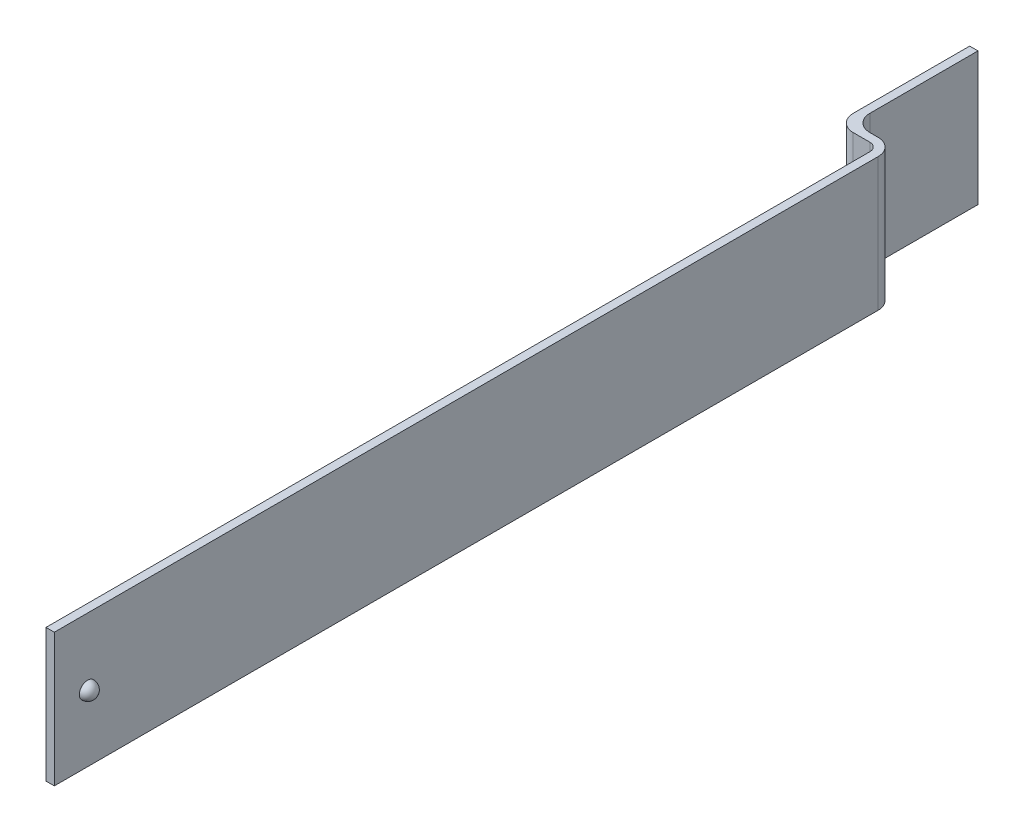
ISO-10303-21;
HEADER;
FILE_DESCRIPTION(('STEP AP214'),'2;1');
FILE_NAME('part.step','',(''),(''),'','','');
FILE_SCHEMA(('AUTOMOTIVE_DESIGN { 1 0 10303 214 1 1 1 1 }'));
ENDSEC;
DATA;
#1=APPLICATION_CONTEXT('core data for automotive mechanical design processes');
#2=APPLICATION_PROTOCOL_DEFINITION('international standard','automotive_design',2000,#1);
#3=PRODUCT_CONTEXT('',#1,'mechanical');
#4=PRODUCT('Part','Part','',(#3));
#5=PRODUCT_RELATED_PRODUCT_CATEGORY('part','',(#4));
#6=PRODUCT_DEFINITION_FORMATION('','',#4);
#7=PRODUCT_DEFINITION_CONTEXT('part definition',#1,'design');
#8=PRODUCT_DEFINITION('design','',#6,#7);
#9=PRODUCT_DEFINITION_SHAPE('','',#8);
#10=(LENGTH_UNIT() NAMED_UNIT(*) SI_UNIT(.MILLI.,.METRE.));
#11=(NAMED_UNIT(*) PLANE_ANGLE_UNIT() SI_UNIT($,.RADIAN.));
#12=(NAMED_UNIT(*) SI_UNIT($,.STERADIAN.) SOLID_ANGLE_UNIT());
#13=UNCERTAINTY_MEASURE_WITH_UNIT(LENGTH_MEASURE(1.E-05),#10,'distance_accuracy_value','');
#14=(GEOMETRIC_REPRESENTATION_CONTEXT(3) GLOBAL_UNCERTAINTY_ASSIGNED_CONTEXT((#13)) GLOBAL_UNIT_ASSIGNED_CONTEXT((#10,
#11,#12)) REPRESENTATION_CONTEXT('',''));
#15=CARTESIAN_POINT('',(0.,0.,0.));
#16=DIRECTION('',(0.,0.,1.));
#17=DIRECTION('',(1.,0.,0.));
#18=AXIS2_PLACEMENT_3D('',#15,#16,#17);
#19=CARTESIAN_POINT('',(0.5,0.,50.));
#20=DIRECTION('',(-1.,0.,0.));
#21=DIRECTION('',(0.,0.,1.));
#22=AXIS2_PLACEMENT_3D('',#19,#20,#21);
#23=PLANE('',#22);
#24=DIRECTION('',(0.,0.,-1.));
#25=VECTOR('',#24,1.);
#26=CARTESIAN_POINT('',(0.5,0.,50.));
#27=LINE('',#26,#25);
#28=CARTESIAN_POINT('',(0.5,0.,50.));
#29=VERTEX_POINT('',#28);
#30=CARTESIAN_POINT('',(0.5,0.,0.5));
#31=VERTEX_POINT('',#30);
#32=EDGE_CURVE('E209',#29,#31,#27,.T.);
#33=ORIENTED_EDGE('',*,*,#32,.T.);
#34=DIRECTION('',(0.,-1.,0.));
#35=VECTOR('',#34,1.);
#36=CARTESIAN_POINT('',(0.5,0.,0.5));
#37=LINE('',#36,#35);
#38=CARTESIAN_POINT('',(0.5,8.,0.5));
#39=VERTEX_POINT('',#38);
#40=EDGE_CURVE('E180',#31,#39,#37,.F.);
#41=ORIENTED_EDGE('',*,*,#40,.T.);
#42=DIRECTION('',(0.,0.,-1.));
#43=VECTOR('',#42,1.);
#44=CARTESIAN_POINT('',(0.5,8.,50.));
#45=LINE('',#44,#43);
#46=CARTESIAN_POINT('',(0.5,8.,50.));
#47=VERTEX_POINT('',#46);
#48=EDGE_CURVE('E206',#47,#39,#45,.T.);
#49=ORIENTED_EDGE('',*,*,#48,.F.);
#50=DIRECTION('',(0.,1.,0.));
#51=VECTOR('',#50,1.);
#52=CARTESIAN_POINT('',(0.5,0.,50.));
#53=LINE('',#52,#51);
#54=EDGE_CURVE('E201',#29,#47,#53,.T.);
#55=ORIENTED_EDGE('',*,*,#54,.F.);
#56=EDGE_LOOP('',(#33,#41,#49,#55));
#57=FACE_BOUND('',#56,.T.);
#58=CARTESIAN_POINT('',(0.5,4.,48.));
#59=DIRECTION('',(-1.,0.,0.));
#60=DIRECTION('',(0.,0.,1.));
#61=AXIS2_PLACEMENT_3D('',#58,#59,#60);
#62=CIRCLE('',#61,0.5);
#63=CARTESIAN_POINT('',(0.5,4.,48.5));
#64=VERTEX_POINT('',#63);
#65=EDGE_CURVE('E11',#64,#64,#62,.F.);
#66=ORIENTED_EDGE('',*,*,#65,.F.);
#67=EDGE_LOOP('',(#66));
#68=FACE_BOUND('',#67,.T.);
#69=ADVANCED_FACE('F31',(#57,#68),#23,.F.);
#70=CARTESIAN_POINT('',(0.,0.,50.));
#71=DIRECTION('',(1.,0.,0.));
#72=DIRECTION('',(0.,0.,-1.));
#73=AXIS2_PLACEMENT_3D('',#70,#71,#72);
#74=PLANE('',#73);
#75=DIRECTION('',(0.,0.,-1.));
#76=VECTOR('',#75,1.);
#77=CARTESIAN_POINT('',(0.,8.,50.));
#78=LINE('',#77,#76);
#79=CARTESIAN_POINT('',(0.,8.,50.));
#80=VERTEX_POINT('',#79);
#81=CARTESIAN_POINT('',(0.,8.,0.5));
#82=VERTEX_POINT('',#81);
#83=EDGE_CURVE('E205',#80,#82,#78,.T.);
#84=ORIENTED_EDGE('',*,*,#83,.T.);
#85=DIRECTION('',(0.,-1.,0.));
#86=VECTOR('',#85,1.);
#87=CARTESIAN_POINT('',(0.,0.,0.5));
#88=LINE('',#87,#86);
#89=CARTESIAN_POINT('',(0.,0.,0.5));
#90=VERTEX_POINT('',#89);
#91=EDGE_CURVE('E186',#82,#90,#88,.T.);
#92=ORIENTED_EDGE('',*,*,#91,.T.);
#93=DIRECTION('',(0.,0.,-1.));
#94=VECTOR('',#93,1.);
#95=CARTESIAN_POINT('',(0.,0.,50.));
#96=LINE('',#95,#94);
#97=CARTESIAN_POINT('',(0.,0.,50.));
#98=VERTEX_POINT('',#97);
#99=EDGE_CURVE('E163',#98,#90,#96,.T.);
#100=ORIENTED_EDGE('',*,*,#99,.F.);
#101=DIRECTION('',(0.,-1.,0.));
#102=VECTOR('',#101,1.);
#103=CARTESIAN_POINT('',(0.,0.,50.));
#104=LINE('',#103,#102);
#105=EDGE_CURVE('E195',#80,#98,#104,.T.);
#106=ORIENTED_EDGE('',*,*,#105,.F.);
#107=EDGE_LOOP('',(#84,#92,#100,#106));
#108=FACE_BOUND('',#107,.T.);
#109=ADVANCED_FACE('F219',(#108),#74,.F.);
#110=CARTESIAN_POINT('',(0.,0.,50.));
#111=DIRECTION('',(0.,1.,0.));
#112=DIRECTION('',(0.,0.,1.));
#113=AXIS2_PLACEMENT_3D('',#110,#111,#112);
#114=PLANE('',#113);
#115=DIRECTION('',(1.,0.,0.));
#116=VECTOR('',#115,1.);
#117=CARTESIAN_POINT('',(0.,0.,0.));
#118=LINE('',#117,#116);
#119=CARTESIAN_POINT('',(-1.5,0.,0.));
#120=VERTEX_POINT('',#119);
#121=CARTESIAN_POINT('',(-0.5,0.,0.));
#122=VERTEX_POINT('',#121);
#123=EDGE_CURVE('E148',#120,#122,#118,.T.);
#124=ORIENTED_EDGE('',*,*,#123,.F.);
#125=CARTESIAN_POINT('',(-1.5,0.,-1.));
#126=DIRECTION('',(0.,1.,0.));
#127=DIRECTION('',(0.,0.,1.));
#128=AXIS2_PLACEMENT_3D('',#125,#126,#127);
#129=CIRCLE('',#128,1.);
#130=CARTESIAN_POINT('',(-2.5,0.,-1.));
#131=VERTEX_POINT('',#130);
#132=EDGE_CURVE('E165',#120,#131,#129,.F.);
#133=ORIENTED_EDGE('',*,*,#132,.T.);
#134=DIRECTION('',(0.,0.,1.));
#135=VECTOR('',#134,1.);
#136=CARTESIAN_POINT('',(-2.5,0.,0.));
#137=LINE('',#136,#135);
#138=CARTESIAN_POINT('',(-2.5,0.,-8.));
#139=VERTEX_POINT('',#138);
#140=EDGE_CURVE('E146',#139,#131,#137,.T.);
#141=ORIENTED_EDGE('',*,*,#140,.F.);
#142=DIRECTION('',(-1.,0.,0.));
#143=VECTOR('',#142,1.);
#144=CARTESIAN_POINT('',(-2.5,0.,-8.));
#145=LINE('',#144,#143);
#146=CARTESIAN_POINT('',(-2.,0.,-8.));
#147=VERTEX_POINT('',#146);
#148=EDGE_CURVE('E131',#147,#139,#145,.T.);
#149=ORIENTED_EDGE('',*,*,#148,.F.);
#150=DIRECTION('',(0.,0.,-1.));
#151=VECTOR('',#150,1.);
#152=CARTESIAN_POINT('',(-2.,0.,-0.5));
#153=LINE('',#152,#151);
#154=CARTESIAN_POINT('',(-2.,0.,-1.5));
#155=VERTEX_POINT('',#154);
#156=EDGE_CURVE('E122',#155,#147,#153,.T.);
#157=ORIENTED_EDGE('',*,*,#156,.F.);
#158=CARTESIAN_POINT('',(-1.,0.,-1.5));
#159=DIRECTION('',(0.,1.,0.));
#160=DIRECTION('',(0.,0.,1.));
#161=AXIS2_PLACEMENT_3D('',#158,#159,#160);
#162=CIRCLE('',#161,1.);
#163=CARTESIAN_POINT('',(-1.,0.,-0.5));
#164=VERTEX_POINT('',#163);
#165=EDGE_CURVE('E182',#155,#164,#162,.T.);
#166=ORIENTED_EDGE('',*,*,#165,.T.);
#167=DIRECTION('',(-1.,0.,0.));
#168=VECTOR('',#167,1.);
#169=CARTESIAN_POINT('',(0.5,0.,-0.5));
#170=LINE('',#169,#168);
#171=CARTESIAN_POINT('',(-0.5,0.,-0.5));
#172=VERTEX_POINT('',#171);
#173=EDGE_CURVE('E132',#172,#164,#170,.T.);
#174=ORIENTED_EDGE('',*,*,#173,.F.);
#175=CARTESIAN_POINT('',(-0.5,0.,0.5));
#176=DIRECTION('',(0.,1.,0.));
#177=DIRECTION('',(0.,0.,1.));
#178=AXIS2_PLACEMENT_3D('',#175,#176,#177);
#179=CIRCLE('',#178,1.);
#180=EDGE_CURVE('E162',#172,#31,#179,.F.);
#181=ORIENTED_EDGE('',*,*,#180,.T.);
#182=ORIENTED_EDGE('',*,*,#32,.F.);
#183=DIRECTION('',(1.,0.,0.));
#184=VECTOR('',#183,1.);
#185=CARTESIAN_POINT('',(0.,0.,50.));
#186=LINE('',#185,#184);
#187=EDGE_CURVE('E198',#98,#29,#186,.T.);
#188=ORIENTED_EDGE('',*,*,#187,.F.);
#189=ORIENTED_EDGE('',*,*,#99,.T.);
#190=CARTESIAN_POINT('',(-0.5,0.,0.5));
#191=DIRECTION('',(0.,1.,0.));
#192=DIRECTION('',(0.,0.,1.));
#193=AXIS2_PLACEMENT_3D('',#190,#191,#192);
#194=CIRCLE('',#193,0.5);
#195=EDGE_CURVE('E46',#90,#122,#194,.T.);
#196=ORIENTED_EDGE('',*,*,#195,.T.);
#197=EDGE_LOOP('',(#124,#133,#141,#149,#157,#166,#174,#181,#182,#188,#189,#196));
#198=FACE_BOUND('',#197,.T.);
#199=ADVANCED_FACE('F144',(#198),#114,.F.);
#200=CARTESIAN_POINT('',(0.,8.,50.));
#201=DIRECTION('',(0.,-1.,0.));
#202=DIRECTION('',(0.,0.,-1.));
#203=AXIS2_PLACEMENT_3D('',#200,#201,#202);
#204=PLANE('',#203);
#205=DIRECTION('',(0.,0.,-1.));
#206=VECTOR('',#205,1.);
#207=CARTESIAN_POINT('',(-2.5,8.,0.));
#208=LINE('',#207,#206);
#209=CARTESIAN_POINT('',(-2.5,8.,-1.));
#210=VERTEX_POINT('',#209);
#211=CARTESIAN_POINT('',(-2.5,8.,-8.));
#212=VERTEX_POINT('',#211);
#213=EDGE_CURVE('E191',#210,#212,#208,.T.);
#214=ORIENTED_EDGE('',*,*,#213,.F.);
#215=CARTESIAN_POINT('',(-1.5,8.,-1.));
#216=DIRECTION('',(0.,-1.,0.));
#217=DIRECTION('',(0.,0.,-1.));
#218=AXIS2_PLACEMENT_3D('',#215,#216,#217);
#219=CIRCLE('',#218,1.);
#220=CARTESIAN_POINT('',(-1.5,8.,0.));
#221=VERTEX_POINT('',#220);
#222=EDGE_CURVE('E171',#210,#221,#219,.F.);
#223=ORIENTED_EDGE('',*,*,#222,.T.);
#224=DIRECTION('',(-1.,0.,0.));
#225=VECTOR('',#224,1.);
#226=CARTESIAN_POINT('',(0.,8.,0.));
#227=LINE('',#226,#225);
#228=CARTESIAN_POINT('',(-0.5,8.,0.));
#229=VERTEX_POINT('',#228);
#230=EDGE_CURVE('E141',#229,#221,#227,.T.);
#231=ORIENTED_EDGE('',*,*,#230,.F.);
#232=CARTESIAN_POINT('',(-0.5,8.,0.5));
#233=DIRECTION('',(0.,-1.,0.));
#234=DIRECTION('',(0.,0.,-1.));
#235=AXIS2_PLACEMENT_3D('',#232,#233,#234);
#236=CIRCLE('',#235,0.5);
#237=EDGE_CURVE('E39',#229,#82,#236,.T.);
#238=ORIENTED_EDGE('',*,*,#237,.T.);
#239=ORIENTED_EDGE('',*,*,#83,.F.);
#240=DIRECTION('',(-1.,0.,0.));
#241=VECTOR('',#240,1.);
#242=CARTESIAN_POINT('',(0.,8.,50.));
#243=LINE('',#242,#241);
#244=EDGE_CURVE('E203',#47,#80,#243,.T.);
#245=ORIENTED_EDGE('',*,*,#244,.F.);
#246=ORIENTED_EDGE('',*,*,#48,.T.);
#247=CARTESIAN_POINT('',(-0.5,8.,0.5));
#248=DIRECTION('',(0.,-1.,0.));
#249=DIRECTION('',(0.,0.,-1.));
#250=AXIS2_PLACEMENT_3D('',#247,#248,#249);
#251=CIRCLE('',#250,1.);
#252=CARTESIAN_POINT('',(-0.5,8.,-0.5));
#253=VERTEX_POINT('',#252);
#254=EDGE_CURVE('E169',#39,#253,#251,.F.);
#255=ORIENTED_EDGE('',*,*,#254,.T.);
#256=DIRECTION('',(1.,0.,0.));
#257=VECTOR('',#256,1.);
#258=CARTESIAN_POINT('',(0.5,8.,-0.5));
#259=LINE('',#258,#257);
#260=CARTESIAN_POINT('',(-1.,8.,-0.5));
#261=VERTEX_POINT('',#260);
#262=EDGE_CURVE('E199',#261,#253,#259,.T.);
#263=ORIENTED_EDGE('',*,*,#262,.F.);
#264=CARTESIAN_POINT('',(-1.,8.,-1.5));
#265=DIRECTION('',(0.,-1.,0.));
#266=DIRECTION('',(0.,0.,-1.));
#267=AXIS2_PLACEMENT_3D('',#264,#265,#266);
#268=CIRCLE('',#267,1.);
#269=CARTESIAN_POINT('',(-2.,8.,-1.5));
#270=VERTEX_POINT('',#269);
#271=EDGE_CURVE('E184',#261,#270,#268,.T.);
#272=ORIENTED_EDGE('',*,*,#271,.T.);
#273=DIRECTION('',(0.,0.,1.));
#274=VECTOR('',#273,1.);
#275=CARTESIAN_POINT('',(-2.,8.,-0.5));
#276=LINE('',#275,#274);
#277=CARTESIAN_POINT('',(-2.,8.,-8.));
#278=VERTEX_POINT('',#277);
#279=EDGE_CURVE('E302',#278,#270,#276,.T.);
#280=ORIENTED_EDGE('',*,*,#279,.F.);
#281=DIRECTION('',(1.,0.,0.));
#282=VECTOR('',#281,1.);
#283=CARTESIAN_POINT('',(-2.5,8.,-8.));
#284=LINE('',#283,#282);
#285=EDGE_CURVE('E140',#212,#278,#284,.T.);
#286=ORIENTED_EDGE('',*,*,#285,.F.);
#287=EDGE_LOOP('',(#214,#223,#231,#238,#239,#245,#246,#255,#263,#272,#280,#286));
#288=FACE_BOUND('',#287,.T.);
#289=ADVANCED_FACE('F226',(#288),#204,.F.);
#290=CARTESIAN_POINT('',(0.,8.,50.));
#291=DIRECTION('',(0.,0.,-1.));
#292=DIRECTION('',(-1.,0.,0.));
#293=AXIS2_PLACEMENT_3D('',#290,#291,#292);
#294=PLANE('',#293);
#295=ORIENTED_EDGE('',*,*,#105,.T.);
#296=ORIENTED_EDGE('',*,*,#187,.T.);
#297=ORIENTED_EDGE('',*,*,#54,.T.);
#298=ORIENTED_EDGE('',*,*,#244,.T.);
#299=EDGE_LOOP('',(#295,#296,#297,#298));
#300=FACE_BOUND('',#299,.T.);
#301=ADVANCED_FACE('F263',(#300),#294,.F.);
#302=CARTESIAN_POINT('',(0.,16.5440037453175,0.));
#303=DIRECTION('',(0.,0.,-1.));
#304=DIRECTION('',(-1.,0.,0.));
#305=AXIS2_PLACEMENT_3D('',#302,#303,#304);
#306=PLANE('',#305);
#307=ORIENTED_EDGE('',*,*,#123,.T.);
#308=DIRECTION('',(0.,-1.,0.));
#309=VECTOR('',#308,1.);
#310=CARTESIAN_POINT('',(-0.5,8.,0.));
#311=LINE('',#310,#309);
#312=EDGE_CURVE('E53',#122,#229,#311,.F.);
#313=ORIENTED_EDGE('',*,*,#312,.T.);
#314=ORIENTED_EDGE('',*,*,#230,.T.);
#315=DIRECTION('',(0.,-1.,0.));
#316=VECTOR('',#315,1.);
#317=CARTESIAN_POINT('',(-1.5,16.5440037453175,0.));
#318=LINE('',#317,#316);
#319=EDGE_CURVE('E159',#221,#120,#318,.T.);
#320=ORIENTED_EDGE('',*,*,#319,.T.);
#321=EDGE_LOOP('',(#307,#313,#314,#320));
#322=FACE_BOUND('',#321,.T.);
#323=ADVANCED_FACE('F229',(#322),#306,.F.);
#324=CARTESIAN_POINT('',(-2.5,16.5440037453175,0.));
#325=DIRECTION('',(1.,0.,0.));
#326=DIRECTION('',(0.,0.,-1.));
#327=AXIS2_PLACEMENT_3D('',#324,#325,#326);
#328=PLANE('',#327);
#329=ORIENTED_EDGE('',*,*,#140,.T.);
#330=DIRECTION('',(0.,-1.,0.));
#331=VECTOR('',#330,1.);
#332=CARTESIAN_POINT('',(-2.5,16.5440037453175,-1.));
#333=LINE('',#332,#331);
#334=EDGE_CURVE('E167',#131,#210,#333,.F.);
#335=ORIENTED_EDGE('',*,*,#334,.T.);
#336=ORIENTED_EDGE('',*,*,#213,.T.);
#337=DIRECTION('',(0.,-1.,0.));
#338=VECTOR('',#337,1.);
#339=CARTESIAN_POINT('',(-2.5,16.5440037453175,-8.));
#340=LINE('',#339,#338);
#341=EDGE_CURVE('E142',#212,#139,#340,.T.);
#342=ORIENTED_EDGE('',*,*,#341,.T.);
#343=EDGE_LOOP('',(#329,#335,#336,#342));
#344=FACE_BOUND('',#343,.T.);
#345=ADVANCED_FACE('F233',(#344),#328,.F.);
#346=CARTESIAN_POINT('',(-2.5,16.5440037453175,-8.));
#347=DIRECTION('',(0.,0.,1.));
#348=DIRECTION('',(1.,0.,0.));
#349=AXIS2_PLACEMENT_3D('',#346,#347,#348);
#350=PLANE('',#349);
#351=ORIENTED_EDGE('',*,*,#341,.F.);
#352=ORIENTED_EDGE('',*,*,#285,.T.);
#353=DIRECTION('',(0.,-1.,0.));
#354=VECTOR('',#353,1.);
#355=CARTESIAN_POINT('',(-2.,16.5440037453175,-8.));
#356=LINE('',#355,#354);
#357=EDGE_CURVE('E126',#278,#147,#356,.T.);
#358=ORIENTED_EDGE('',*,*,#357,.T.);
#359=ORIENTED_EDGE('',*,*,#148,.T.);
#360=EDGE_LOOP('',(#351,#352,#358,#359));
#361=FACE_BOUND('',#360,.T.);
#362=ADVANCED_FACE('F137',(#361),#350,.F.);
#363=CARTESIAN_POINT('',(-2.,16.5440037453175,-0.5));
#364=DIRECTION('',(-1.,0.,0.));
#365=DIRECTION('',(0.,0.,1.));
#366=AXIS2_PLACEMENT_3D('',#363,#364,#365);
#367=PLANE('',#366);
#368=ORIENTED_EDGE('',*,*,#279,.T.);
#369=DIRECTION('',(0.,-1.,0.));
#370=VECTOR('',#369,1.);
#371=CARTESIAN_POINT('',(-2.,0.,-1.5));
#372=LINE('',#371,#370);
#373=EDGE_CURVE('E129',#270,#155,#372,.T.);
#374=ORIENTED_EDGE('',*,*,#373,.T.);
#375=ORIENTED_EDGE('',*,*,#156,.T.);
#376=ORIENTED_EDGE('',*,*,#357,.F.);
#377=EDGE_LOOP('',(#368,#374,#375,#376));
#378=FACE_BOUND('',#377,.T.);
#379=ADVANCED_FACE('F125',(#378),#367,.F.);
#380=CARTESIAN_POINT('',(0.5,16.5440037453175,-0.5));
#381=DIRECTION('',(0.,0.,1.));
#382=DIRECTION('',(1.,0.,0.));
#383=AXIS2_PLACEMENT_3D('',#380,#381,#382);
#384=PLANE('',#383);
#385=ORIENTED_EDGE('',*,*,#173,.T.);
#386=DIRECTION('',(0.,-1.,0.));
#387=VECTOR('',#386,1.);
#388=CARTESIAN_POINT('',(-1.,8.,-0.5));
#389=LINE('',#388,#387);
#390=EDGE_CURVE('E178',#164,#261,#389,.F.);
#391=ORIENTED_EDGE('',*,*,#390,.T.);
#392=ORIENTED_EDGE('',*,*,#262,.T.);
#393=DIRECTION('',(0.,-1.,0.));
#394=VECTOR('',#393,1.);
#395=CARTESIAN_POINT('',(-0.5,16.5440037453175,-0.5));
#396=LINE('',#395,#394);
#397=EDGE_CURVE('E175',#253,#172,#396,.T.);
#398=ORIENTED_EDGE('',*,*,#397,.T.);
#399=EDGE_LOOP('',(#385,#391,#392,#398));
#400=FACE_BOUND('',#399,.T.);
#401=ADVANCED_FACE('F237',(#400),#384,.F.);
#402=CARTESIAN_POINT('',(-1.5,16.5440037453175,-1.));
#403=DIRECTION('',(0.,-1.,0.));
#404=DIRECTION('',(0.,0.,-1.));
#405=AXIS2_PLACEMENT_3D('',#402,#403,#404);
#406=CYLINDRICAL_SURFACE('',#405,1.);
#407=ORIENTED_EDGE('',*,*,#222,.F.);
#408=ORIENTED_EDGE('',*,*,#334,.F.);
#409=ORIENTED_EDGE('',*,*,#132,.F.);
#410=ORIENTED_EDGE('',*,*,#319,.F.);
#411=EDGE_LOOP('',(#407,#408,#409,#410));
#412=FACE_BOUND('',#411,.T.);
#413=ADVANCED_FACE('F234',(#412),#406,.T.);
#414=CARTESIAN_POINT('',(-1.,16.5440037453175,-1.5));
#415=DIRECTION('',(0.,1.,0.));
#416=DIRECTION('',(0.,0.,1.));
#417=AXIS2_PLACEMENT_3D('',#414,#415,#416);
#418=CYLINDRICAL_SURFACE('',#417,1.);
#419=ORIENTED_EDGE('',*,*,#271,.F.);
#420=ORIENTED_EDGE('',*,*,#390,.F.);
#421=ORIENTED_EDGE('',*,*,#165,.F.);
#422=ORIENTED_EDGE('',*,*,#373,.F.);
#423=EDGE_LOOP('',(#419,#420,#421,#422));
#424=FACE_BOUND('',#423,.T.);
#425=ADVANCED_FACE('F236',(#424),#418,.F.);
#426=CARTESIAN_POINT('',(-0.5,16.5440037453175,0.5));
#427=DIRECTION('',(0.,-1.,0.));
#428=DIRECTION('',(0.,0.,-1.));
#429=AXIS2_PLACEMENT_3D('',#426,#427,#428);
#430=CYLINDRICAL_SURFACE('',#429,1.);
#431=ORIENTED_EDGE('',*,*,#254,.F.);
#432=ORIENTED_EDGE('',*,*,#40,.F.);
#433=ORIENTED_EDGE('',*,*,#180,.F.);
#434=ORIENTED_EDGE('',*,*,#397,.F.);
#435=EDGE_LOOP('',(#431,#432,#433,#434));
#436=FACE_BOUND('',#435,.T.);
#437=ADVANCED_FACE('F243',(#436),#430,.T.);
#438=CARTESIAN_POINT('',(-0.5,0.,0.5));
#439=DIRECTION('',(0.,1.,0.));
#440=DIRECTION('',(0.,0.,1.));
#441=AXIS2_PLACEMENT_3D('',#438,#439,#440);
#442=CYLINDRICAL_SURFACE('',#441,0.5);
#443=ORIENTED_EDGE('',*,*,#237,.F.);
#444=ORIENTED_EDGE('',*,*,#312,.F.);
#445=ORIENTED_EDGE('',*,*,#195,.F.);
#446=ORIENTED_EDGE('',*,*,#91,.F.);
#447=EDGE_LOOP('',(#443,#444,#445,#446));
#448=FACE_BOUND('',#447,.T.);
#449=ADVANCED_FACE('F33',(#448),#442,.F.);
#450=CARTESIAN_POINT('',(0.5,4.,48.));
#451=DIRECTION('',(-1.,0.,0.));
#452=DIRECTION('',(0.,0.,1.));
#453=AXIS2_PLACEMENT_3D('',#450,#451,#452);
#454=SPHERICAL_SURFACE('',#453,0.5);
#455=ORIENTED_EDGE('',*,*,#65,.T.);
#456=EDGE_LOOP('',(#455));
#457=FACE_BOUND('',#456,.T.);
#458=ADVANCED_FACE('F279',(#457),#454,.T.);
#459=CLOSED_SHELL('',(#69,#109,#199,#289,#301,#323,#345,#362,#379,#401,#413,#425,#437,#449,#458));
#460=MANIFOLD_SOLID_BREP('B2',#459);
#461=ADVANCED_BREP_SHAPE_REPRESENTATION('',(#18,#460),#14);
#462=SHAPE_DEFINITION_REPRESENTATION(#9,#461);
ENDSEC;
END-ISO-10303-21;
